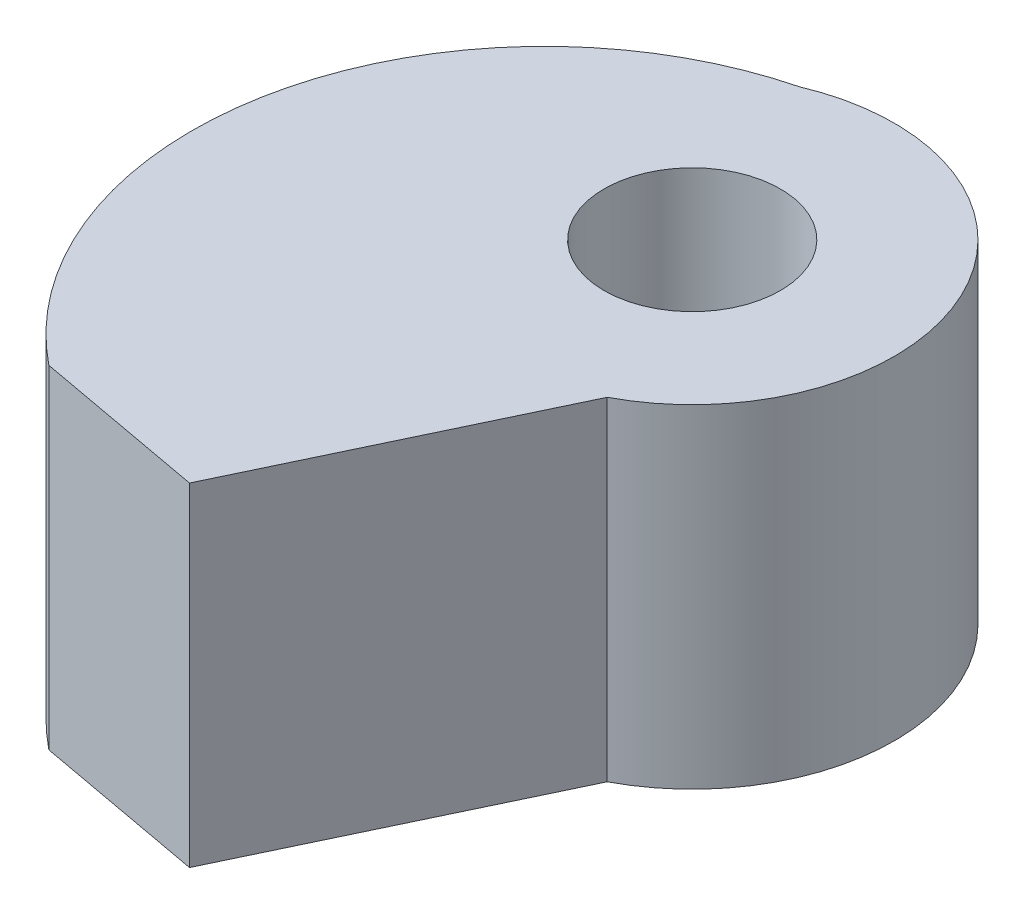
from build123d import *

# Parameters (mm, degrees)
ESQUISSE1_R             = 5.158029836
ESQUISSE1_R_2           = 2.45
BOSS_EXTRU_1_DEPTH      = 2.5
ESQUISSE2_R             = 5.158029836
ESQUISSE2_R_2           = 1
BOSS_EXTRU_2_DEPTH      = 6
ESQUISSE3_R             = 2.25
ENL_V_MAT_EXTRU_1_DEPTH = 5.5
BOSS_EXTRU_3_DEPTH      = 8.5


with BuildPart() as part:
    # Esquisse1 → Boss.-Extru.1 (new body)
    with BuildSketch(Plane(origin=(0, 0, 0), x_dir=(1, 0, 0), z_dir=(0, 1, 0))):
        with Locations(Location((0, 0, 0), (0, 0, 270))):
            Circle(ESQUISSE1_R)
        with Locations(Location((0, 0, 0), (0, 0, 270))):
            Circle(ESQUISSE1_R_2, mode=Mode.SUBTRACT)
    extrude(amount=BOSS_EXTRU_1_DEPTH)

    # Esquisse2 → Boss.-Extru.2 (add)
    with BuildSketch(Plane(origin=(0, 2.5, 0), x_dir=(1, 0, 0), z_dir=(0, 1, 0))):
        with Locations(Location((0, 0, 0), (0, 0, 270))):
            Circle(ESQUISSE2_R)
        with Locations(Location((0, 0, 0), (0, 0, 270))):
            Circle(ESQUISSE2_R_2, mode=Mode.SUBTRACT)
    extrude(amount=BOSS_EXTRU_2_DEPTH)

    # Esquisse3 → Enl_v. mat.-Extru.1 (cut)
    with BuildSketch(Plane(origin=(0, 8.5, 0), x_dir=(1, 0, 0), z_dir=(0, 1, 0))):
        with Locations(Location((0, 0, 0), (0, 0, 270))):
            Circle(ESQUISSE3_R)
    extrude(amount=-ENL_V_MAT_EXTRU_1_DEPTH, mode=Mode.SUBTRACT)

    # Esquisse4 → Boss.-Extru.3 (add)
    with BuildSketch(Plane(origin=(0, 8.5, 0), x_dir=(1, 0, 0), z_dir=(0, 1, 0))):
        with BuildLine():
            Line((-1.037795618, -11.793856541), (2.397590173, -4.566928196))
            Line((2.397590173, -4.566928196), (-3.163581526, -1.890920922))
            Line((-3.163581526, -1.890920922), (-2.822551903, 2.539113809))
            Line((-2.822551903, 2.539113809), (1.508201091, 4.932605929))
            ThreePointArc((1.508201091, 4.932605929), (-8.045655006, -0.374198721), (-5.435325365, -10.986668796))
            Line((-5.435325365, -10.986668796), (-1.037795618, -11.793856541))
        make_face()
    extrude(amount=-BOSS_EXTRU_3_DEPTH)


solid = part.part
